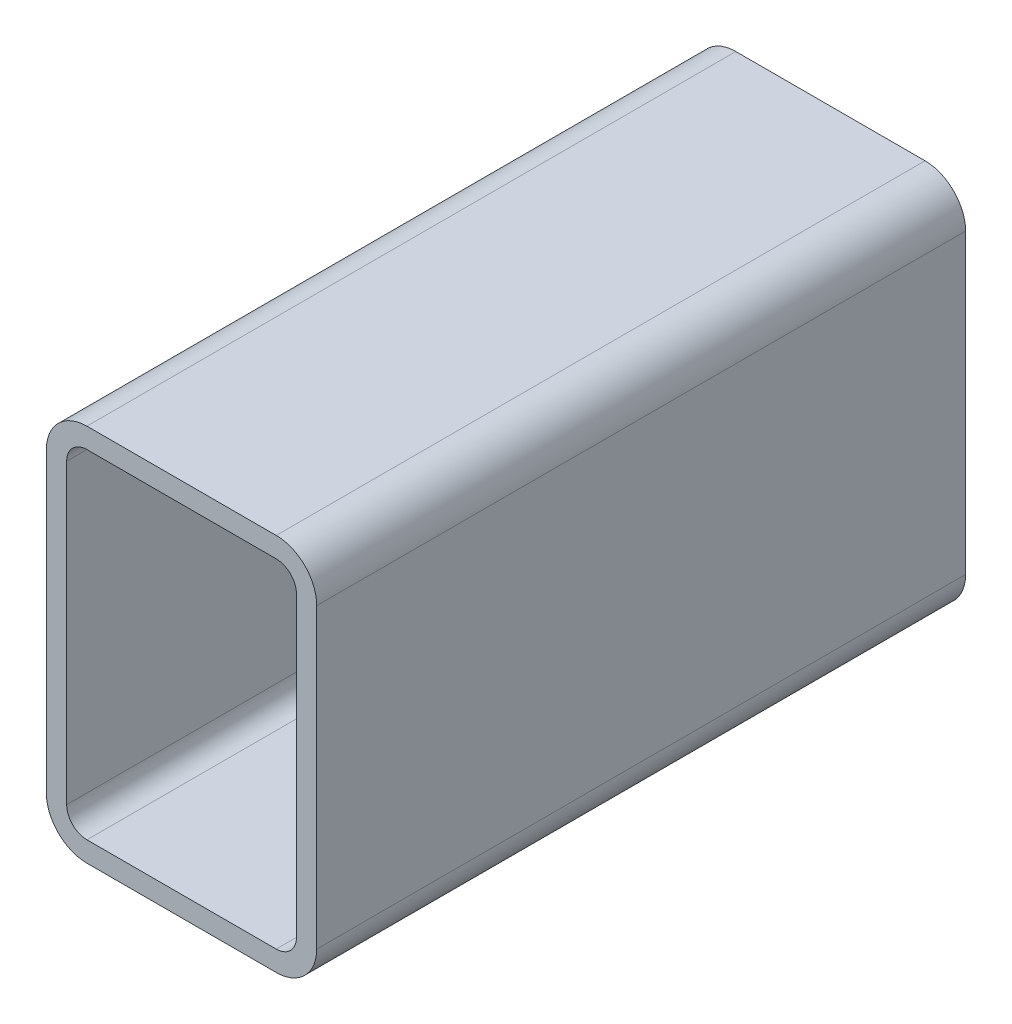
ISO-10303-21;
HEADER;
FILE_DESCRIPTION(('STEP AP214'),'2;1');
FILE_NAME('part.step','',(''),(''),'','','');
FILE_SCHEMA(('AUTOMOTIVE_DESIGN { 1 0 10303 214 1 1 1 1 }'));
ENDSEC;
DATA;
#1=APPLICATION_CONTEXT('core data for automotive mechanical design processes');
#2=APPLICATION_PROTOCOL_DEFINITION('international standard','automotive_design',2000,#1);
#3=PRODUCT_CONTEXT('',#1,'mechanical');
#4=PRODUCT('Part','Part','',(#3));
#5=PRODUCT_RELATED_PRODUCT_CATEGORY('part','',(#4));
#6=PRODUCT_DEFINITION_FORMATION('','',#4);
#7=PRODUCT_DEFINITION_CONTEXT('part definition',#1,'design');
#8=PRODUCT_DEFINITION('design','',#6,#7);
#9=PRODUCT_DEFINITION_SHAPE('','',#8);
#10=(LENGTH_UNIT() NAMED_UNIT(*) SI_UNIT(.MILLI.,.METRE.));
#11=(NAMED_UNIT(*) PLANE_ANGLE_UNIT() SI_UNIT($,.RADIAN.));
#12=(NAMED_UNIT(*) SI_UNIT($,.STERADIAN.) SOLID_ANGLE_UNIT());
#13=UNCERTAINTY_MEASURE_WITH_UNIT(LENGTH_MEASURE(1.E-05),#10,'distance_accuracy_value','');
#14=(GEOMETRIC_REPRESENTATION_CONTEXT(3) GLOBAL_UNCERTAINTY_ASSIGNED_CONTEXT((#13)) GLOBAL_UNIT_ASSIGNED_CONTEXT((#10,
#11,#12)) REPRESENTATION_CONTEXT('',''));
#15=CARTESIAN_POINT('',(0.,0.,0.));
#16=DIRECTION('',(0.,0.,1.));
#17=DIRECTION('',(1.,0.,0.));
#18=AXIS2_PLACEMENT_3D('',#15,#16,#17);
#19=CARTESIAN_POINT('',(19.9112396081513,160.739039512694,304.8));
#20=DIRECTION('',(0.,0.,1.));
#21=DIRECTION('',(1.,0.,0.));
#22=AXIS2_PLACEMENT_3D('',#19,#20,#21);
#23=PLANE('',#22);
#24=CARTESIAN_POINT('',(19.9112396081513,160.739039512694,304.8));
#25=DIRECTION('',(0.,0.,1.));
#26=DIRECTION('',(1.,0.,0.));
#27=AXIS2_PLACEMENT_3D('',#24,#25,#26);
#28=CIRCLE('',#27,19.05);
#29=CARTESIAN_POINT('',(19.9112396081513,179.789039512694,304.8));
#30=VERTEX_POINT('',#29);
#31=CARTESIAN_POINT('',(0.8612396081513,160.739039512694,304.8));
#32=VERTEX_POINT('',#31);
#33=EDGE_CURVE('E211',#30,#32,#28,.T.);
#34=ORIENTED_EDGE('',*,*,#33,.T.);
#35=DIRECTION('',(0.,-1.,0.));
#36=VECTOR('',#35,1.);
#37=CARTESIAN_POINT('',(0.8612396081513,21.0390395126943,304.8));
#38=LINE('',#37,#36);
#39=CARTESIAN_POINT('',(0.8612396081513,21.0390395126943,304.8));
#40=VERTEX_POINT('',#39);
#41=EDGE_CURVE('E214',#32,#40,#38,.T.);
#42=ORIENTED_EDGE('',*,*,#41,.T.);
#43=CARTESIAN_POINT('',(19.9112396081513,21.0390395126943,304.8));
#44=DIRECTION('',(0.,0.,1.));
#45=DIRECTION('',(1.,0.,0.));
#46=AXIS2_PLACEMENT_3D('',#43,#44,#45);
#47=CIRCLE('',#46,19.05);
#48=CARTESIAN_POINT('',(19.9112396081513,1.98903951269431,304.8));
#49=VERTEX_POINT('',#48);
#50=EDGE_CURVE('E217',#40,#49,#47,.T.);
#51=ORIENTED_EDGE('',*,*,#50,.T.);
#52=DIRECTION('',(1.,0.,0.));
#53=VECTOR('',#52,1.);
#54=CARTESIAN_POINT('',(108.811239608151,1.98903951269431,304.8));
#55=LINE('',#54,#53);
#56=CARTESIAN_POINT('',(108.811239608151,1.98903951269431,304.8));
#57=VERTEX_POINT('',#56);
#58=EDGE_CURVE('E219',#49,#57,#55,.T.);
#59=ORIENTED_EDGE('',*,*,#58,.T.);
#60=CARTESIAN_POINT('',(108.811239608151,21.0390395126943,304.8));
#61=DIRECTION('',(0.,0.,1.));
#62=DIRECTION('',(1.,0.,0.));
#63=AXIS2_PLACEMENT_3D('',#60,#61,#62);
#64=CIRCLE('',#63,19.05);
#65=CARTESIAN_POINT('',(127.861239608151,21.0390395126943,304.8));
#66=VERTEX_POINT('',#65);
#67=EDGE_CURVE('E221',#57,#66,#64,.T.);
#68=ORIENTED_EDGE('',*,*,#67,.T.);
#69=DIRECTION('',(0.,1.,0.));
#70=VECTOR('',#69,1.);
#71=CARTESIAN_POINT('',(127.861239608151,160.739039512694,304.8));
#72=LINE('',#71,#70);
#73=CARTESIAN_POINT('',(127.861239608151,160.739039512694,304.8));
#74=VERTEX_POINT('',#73);
#75=EDGE_CURVE('E223',#66,#74,#72,.T.);
#76=ORIENTED_EDGE('',*,*,#75,.T.);
#77=CARTESIAN_POINT('',(108.811239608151,160.739039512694,304.8));
#78=DIRECTION('',(0.,0.,1.));
#79=DIRECTION('',(1.,0.,0.));
#80=AXIS2_PLACEMENT_3D('',#77,#78,#79);
#81=CIRCLE('',#80,19.05);
#82=CARTESIAN_POINT('',(108.811239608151,179.789039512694,304.8));
#83=VERTEX_POINT('',#82);
#84=EDGE_CURVE('E225',#74,#83,#81,.T.);
#85=ORIENTED_EDGE('',*,*,#84,.T.);
#86=DIRECTION('',(-1.,0.,0.));
#87=VECTOR('',#86,1.);
#88=CARTESIAN_POINT('',(19.9112396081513,179.789039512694,304.8));
#89=LINE('',#88,#87);
#90=EDGE_CURVE('E227',#83,#30,#89,.T.);
#91=ORIENTED_EDGE('',*,*,#90,.T.);
#92=EDGE_LOOP('',(#34,#42,#51,#59,#68,#76,#85,#91));
#93=FACE_BOUND('',#92,.T.);
#94=DIRECTION('',(0.,-1.,0.));
#95=VECTOR('',#94,1.);
#96=CARTESIAN_POINT('',(10.3862396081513,21.0390395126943,304.8));
#97=LINE('',#96,#95);
#98=CARTESIAN_POINT('',(10.3862396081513,160.739039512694,304.8));
#99=VERTEX_POINT('',#98);
#100=CARTESIAN_POINT('',(10.3862396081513,21.0390395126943,304.8));
#101=VERTEX_POINT('',#100);
#102=EDGE_CURVE('E154',#99,#101,#97,.T.);
#103=ORIENTED_EDGE('',*,*,#102,.F.);
#104=CARTESIAN_POINT('',(19.9112396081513,160.739039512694,304.8));
#105=DIRECTION('',(0.,0.,1.));
#106=DIRECTION('',(1.,0.,0.));
#107=AXIS2_PLACEMENT_3D('',#104,#105,#106);
#108=CIRCLE('',#107,9.52500000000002);
#109=CARTESIAN_POINT('',(19.9112396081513,170.264039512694,304.8));
#110=VERTEX_POINT('',#109);
#111=EDGE_CURVE('E146',#110,#99,#108,.T.);
#112=ORIENTED_EDGE('',*,*,#111,.F.);
#113=DIRECTION('',(-1.,0.,0.));
#114=VECTOR('',#113,1.);
#115=CARTESIAN_POINT('',(19.9112396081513,170.264039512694,304.8));
#116=LINE('',#115,#114);
#117=CARTESIAN_POINT('',(108.811239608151,170.264039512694,304.8));
#118=VERTEX_POINT('',#117);
#119=EDGE_CURVE('E179',#118,#110,#116,.T.);
#120=ORIENTED_EDGE('',*,*,#119,.F.);
#121=CARTESIAN_POINT('',(108.811239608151,160.739039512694,304.8));
#122=DIRECTION('',(0.,0.,1.));
#123=DIRECTION('',(1.,0.,0.));
#124=AXIS2_PLACEMENT_3D('',#121,#122,#123);
#125=CIRCLE('',#124,9.52500000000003);
#126=CARTESIAN_POINT('',(118.336239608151,160.739039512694,304.8));
#127=VERTEX_POINT('',#126);
#128=EDGE_CURVE('E177',#127,#118,#125,.T.);
#129=ORIENTED_EDGE('',*,*,#128,.F.);
#130=DIRECTION('',(0.,1.,0.));
#131=VECTOR('',#130,1.);
#132=CARTESIAN_POINT('',(118.336239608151,160.739039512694,304.8));
#133=LINE('',#132,#131);
#134=CARTESIAN_POINT('',(118.336239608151,21.0390395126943,304.8));
#135=VERTEX_POINT('',#134);
#136=EDGE_CURVE('E175',#135,#127,#133,.T.);
#137=ORIENTED_EDGE('',*,*,#136,.F.);
#138=CARTESIAN_POINT('',(108.811239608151,21.0390395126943,304.8));
#139=DIRECTION('',(0.,0.,1.));
#140=DIRECTION('',(1.,0.,0.));
#141=AXIS2_PLACEMENT_3D('',#138,#139,#140);
#142=CIRCLE('',#141,9.52500000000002);
#143=CARTESIAN_POINT('',(108.811239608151,11.5140395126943,304.8));
#144=VERTEX_POINT('',#143);
#145=EDGE_CURVE('E173',#144,#135,#142,.T.);
#146=ORIENTED_EDGE('',*,*,#145,.F.);
#147=DIRECTION('',(1.,0.,0.));
#148=VECTOR('',#147,1.);
#149=CARTESIAN_POINT('',(108.811239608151,11.5140395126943,304.8));
#150=LINE('',#149,#148);
#151=CARTESIAN_POINT('',(19.9112396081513,11.5140395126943,304.8));
#152=VERTEX_POINT('',#151);
#153=EDGE_CURVE('E169',#152,#144,#150,.T.);
#154=ORIENTED_EDGE('',*,*,#153,.F.);
#155=CARTESIAN_POINT('',(19.9112396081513,21.0390395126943,304.8));
#156=DIRECTION('',(0.,0.,1.));
#157=DIRECTION('',(1.,0.,0.));
#158=AXIS2_PLACEMENT_3D('',#155,#156,#157);
#159=CIRCLE('',#158,9.525);
#160=EDGE_CURVE('E167',#101,#152,#159,.T.);
#161=ORIENTED_EDGE('',*,*,#160,.F.);
#162=EDGE_LOOP('',(#103,#112,#120,#129,#137,#146,#154,#161));
#163=FACE_BOUND('',#162,.T.);
#164=ADVANCED_FACE('F33',(#93,#163),#23,.T.);
#165=CARTESIAN_POINT('',(19.9112396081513,160.739039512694,0.));
#166=DIRECTION('',(0.,0.,1.));
#167=DIRECTION('',(1.,0.,0.));
#168=AXIS2_PLACEMENT_3D('',#165,#166,#167);
#169=PLANE('',#168);
#170=CARTESIAN_POINT('',(19.9112396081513,160.739039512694,0.));
#171=DIRECTION('',(0.,0.,1.));
#172=DIRECTION('',(1.,0.,0.));
#173=AXIS2_PLACEMENT_3D('',#170,#171,#172);
#174=CIRCLE('',#173,19.05);
#175=CARTESIAN_POINT('',(19.9112396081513,179.789039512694,0.));
#176=VERTEX_POINT('',#175);
#177=CARTESIAN_POINT('',(0.8612396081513,160.739039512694,0.));
#178=VERTEX_POINT('',#177);
#179=EDGE_CURVE('E162',#176,#178,#174,.T.);
#180=ORIENTED_EDGE('',*,*,#179,.F.);
#181=DIRECTION('',(-1.,0.,0.));
#182=VECTOR('',#181,1.);
#183=CARTESIAN_POINT('',(19.9112396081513,179.789039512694,0.));
#184=LINE('',#183,#182);
#185=CARTESIAN_POINT('',(108.811239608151,179.789039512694,0.));
#186=VERTEX_POINT('',#185);
#187=EDGE_CURVE('E215',#186,#176,#184,.T.);
#188=ORIENTED_EDGE('',*,*,#187,.F.);
#189=CARTESIAN_POINT('',(108.811239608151,160.739039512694,0.));
#190=DIRECTION('',(0.,0.,1.));
#191=DIRECTION('',(1.,0.,0.));
#192=AXIS2_PLACEMENT_3D('',#189,#190,#191);
#193=CIRCLE('',#192,19.05);
#194=CARTESIAN_POINT('',(127.861239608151,160.739039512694,0.));
#195=VERTEX_POINT('',#194);
#196=EDGE_CURVE('E242',#195,#186,#193,.T.);
#197=ORIENTED_EDGE('',*,*,#196,.F.);
#198=DIRECTION('',(0.,1.,0.));
#199=VECTOR('',#198,1.);
#200=CARTESIAN_POINT('',(127.861239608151,160.739039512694,0.));
#201=LINE('',#200,#199);
#202=CARTESIAN_POINT('',(127.861239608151,21.0390395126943,0.));
#203=VERTEX_POINT('',#202);
#204=EDGE_CURVE('E240',#203,#195,#201,.T.);
#205=ORIENTED_EDGE('',*,*,#204,.F.);
#206=CARTESIAN_POINT('',(108.811239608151,21.0390395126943,0.));
#207=DIRECTION('',(0.,0.,1.));
#208=DIRECTION('',(1.,0.,0.));
#209=AXIS2_PLACEMENT_3D('',#206,#207,#208);
#210=CIRCLE('',#209,19.05);
#211=CARTESIAN_POINT('',(108.811239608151,1.98903951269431,0.));
#212=VERTEX_POINT('',#211);
#213=EDGE_CURVE('E238',#212,#203,#210,.T.);
#214=ORIENTED_EDGE('',*,*,#213,.F.);
#215=DIRECTION('',(1.,0.,0.));
#216=VECTOR('',#215,1.);
#217=CARTESIAN_POINT('',(108.811239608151,1.98903951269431,0.));
#218=LINE('',#217,#216);
#219=CARTESIAN_POINT('',(19.9112396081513,1.98903951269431,0.));
#220=VERTEX_POINT('',#219);
#221=EDGE_CURVE('E236',#220,#212,#218,.T.);
#222=ORIENTED_EDGE('',*,*,#221,.F.);
#223=CARTESIAN_POINT('',(19.9112396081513,21.0390395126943,0.));
#224=DIRECTION('',(0.,0.,1.));
#225=DIRECTION('',(1.,0.,0.));
#226=AXIS2_PLACEMENT_3D('',#223,#224,#225);
#227=CIRCLE('',#226,19.05);
#228=CARTESIAN_POINT('',(0.8612396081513,21.0390395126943,0.));
#229=VERTEX_POINT('',#228);
#230=EDGE_CURVE('E234',#229,#220,#227,.T.);
#231=ORIENTED_EDGE('',*,*,#230,.F.);
#232=DIRECTION('',(0.,-1.,0.));
#233=VECTOR('',#232,1.);
#234=CARTESIAN_POINT('',(0.8612396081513,21.0390395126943,0.));
#235=LINE('',#234,#233);
#236=EDGE_CURVE('E232',#178,#229,#235,.T.);
#237=ORIENTED_EDGE('',*,*,#236,.F.);
#238=EDGE_LOOP('',(#180,#188,#197,#205,#214,#222,#231,#237));
#239=FACE_BOUND('',#238,.T.);
#240=CARTESIAN_POINT('',(19.9112396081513,160.739039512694,0.));
#241=DIRECTION('',(0.,0.,1.));
#242=DIRECTION('',(1.,0.,0.));
#243=AXIS2_PLACEMENT_3D('',#240,#241,#242);
#244=CIRCLE('',#243,9.52500000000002);
#245=CARTESIAN_POINT('',(19.9112396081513,170.264039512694,0.));
#246=VERTEX_POINT('',#245);
#247=CARTESIAN_POINT('',(10.3862396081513,160.739039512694,0.));
#248=VERTEX_POINT('',#247);
#249=EDGE_CURVE('E56',#246,#248,#244,.T.);
#250=ORIENTED_EDGE('',*,*,#249,.T.);
#251=DIRECTION('',(0.,-1.,0.));
#252=VECTOR('',#251,1.);
#253=CARTESIAN_POINT('',(10.3862396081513,21.0390395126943,0.));
#254=LINE('',#253,#252);
#255=CARTESIAN_POINT('',(10.3862396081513,21.0390395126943,0.));
#256=VERTEX_POINT('',#255);
#257=EDGE_CURVE('E161',#248,#256,#254,.T.);
#258=ORIENTED_EDGE('',*,*,#257,.T.);
#259=CARTESIAN_POINT('',(19.9112396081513,21.0390395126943,0.));
#260=DIRECTION('',(0.,0.,1.));
#261=DIRECTION('',(1.,0.,0.));
#262=AXIS2_PLACEMENT_3D('',#259,#260,#261);
#263=CIRCLE('',#262,9.525);
#264=CARTESIAN_POINT('',(19.9112396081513,11.5140395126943,0.));
#265=VERTEX_POINT('',#264);
#266=EDGE_CURVE('E183',#256,#265,#263,.T.);
#267=ORIENTED_EDGE('',*,*,#266,.T.);
#268=DIRECTION('',(1.,0.,0.));
#269=VECTOR('',#268,1.);
#270=CARTESIAN_POINT('',(108.811239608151,11.5140395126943,0.));
#271=LINE('',#270,#269);
#272=CARTESIAN_POINT('',(108.811239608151,11.5140395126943,0.));
#273=VERTEX_POINT('',#272);
#274=EDGE_CURVE('E186',#265,#273,#271,.T.);
#275=ORIENTED_EDGE('',*,*,#274,.T.);
#276=CARTESIAN_POINT('',(108.811239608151,21.0390395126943,0.));
#277=DIRECTION('',(0.,0.,1.));
#278=DIRECTION('',(1.,0.,0.));
#279=AXIS2_PLACEMENT_3D('',#276,#277,#278);
#280=CIRCLE('',#279,9.52500000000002);
#281=CARTESIAN_POINT('',(118.336239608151,21.0390395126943,0.));
#282=VERTEX_POINT('',#281);
#283=EDGE_CURVE('E189',#273,#282,#280,.T.);
#284=ORIENTED_EDGE('',*,*,#283,.T.);
#285=DIRECTION('',(0.,1.,0.));
#286=VECTOR('',#285,1.);
#287=CARTESIAN_POINT('',(118.336239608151,160.739039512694,0.));
#288=LINE('',#287,#286);
#289=CARTESIAN_POINT('',(118.336239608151,160.739039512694,0.));
#290=VERTEX_POINT('',#289);
#291=EDGE_CURVE('E192',#282,#290,#288,.T.);
#292=ORIENTED_EDGE('',*,*,#291,.T.);
#293=CARTESIAN_POINT('',(108.811239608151,160.739039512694,0.));
#294=DIRECTION('',(0.,0.,1.));
#295=DIRECTION('',(1.,0.,0.));
#296=AXIS2_PLACEMENT_3D('',#293,#294,#295);
#297=CIRCLE('',#296,9.52500000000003);
#298=CARTESIAN_POINT('',(108.811239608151,170.264039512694,0.));
#299=VERTEX_POINT('',#298);
#300=EDGE_CURVE('E195',#290,#299,#297,.T.);
#301=ORIENTED_EDGE('',*,*,#300,.T.);
#302=DIRECTION('',(-1.,0.,0.));
#303=VECTOR('',#302,1.);
#304=CARTESIAN_POINT('',(19.9112396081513,170.264039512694,0.));
#305=LINE('',#304,#303);
#306=EDGE_CURVE('E155',#299,#246,#305,.T.);
#307=ORIENTED_EDGE('',*,*,#306,.T.);
#308=EDGE_LOOP('',(#250,#258,#267,#275,#284,#292,#301,#307));
#309=FACE_BOUND('',#308,.T.);
#310=ADVANCED_FACE('F272',(#239,#309),#169,.F.);
#311=CARTESIAN_POINT('',(19.9112396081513,160.739039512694,304.8));
#312=DIRECTION('',(0.,0.,-1.));
#313=DIRECTION('',(-1.,0.,0.));
#314=AXIS2_PLACEMENT_3D('',#311,#312,#313);
#315=CYLINDRICAL_SURFACE('',#314,19.05);
#316=ORIENTED_EDGE('',*,*,#179,.T.);
#317=DIRECTION('',(0.,0.,-1.));
#318=VECTOR('',#317,1.);
#319=CARTESIAN_POINT('',(0.8612396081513,160.739039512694,304.8));
#320=LINE('',#319,#318);
#321=EDGE_CURVE('E11',#32,#178,#320,.T.);
#322=ORIENTED_EDGE('',*,*,#321,.F.);
#323=ORIENTED_EDGE('',*,*,#33,.F.);
#324=DIRECTION('',(0.,0.,-1.));
#325=VECTOR('',#324,1.);
#326=CARTESIAN_POINT('',(19.9112396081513,179.789039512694,304.8));
#327=LINE('',#326,#325);
#328=EDGE_CURVE('E229',#30,#176,#327,.T.);
#329=ORIENTED_EDGE('',*,*,#328,.T.);
#330=EDGE_LOOP('',(#316,#322,#323,#329));
#331=FACE_BOUND('',#330,.T.);
#332=ADVANCED_FACE('F35',(#331),#315,.T.);
#333=CARTESIAN_POINT('',(0.8612396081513,21.0390395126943,304.8));
#334=DIRECTION('',(1.,0.,0.));
#335=DIRECTION('',(0.,0.,-1.));
#336=AXIS2_PLACEMENT_3D('',#333,#334,#335);
#337=PLANE('',#336);
#338=ORIENTED_EDGE('',*,*,#236,.T.);
#339=DIRECTION('',(0.,0.,-1.));
#340=VECTOR('',#339,1.);
#341=CARTESIAN_POINT('',(0.8612396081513,21.0390395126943,304.8));
#342=LINE('',#341,#340);
#343=EDGE_CURVE('E41',#40,#229,#342,.T.);
#344=ORIENTED_EDGE('',*,*,#343,.F.);
#345=ORIENTED_EDGE('',*,*,#41,.F.);
#346=ORIENTED_EDGE('',*,*,#321,.T.);
#347=EDGE_LOOP('',(#338,#344,#345,#346));
#348=FACE_BOUND('',#347,.T.);
#349=ADVANCED_FACE('F289',(#348),#337,.F.);
#350=CARTESIAN_POINT('',(19.9112396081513,21.0390395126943,304.8));
#351=DIRECTION('',(0.,0.,-1.));
#352=DIRECTION('',(-1.,0.,0.));
#353=AXIS2_PLACEMENT_3D('',#350,#351,#352);
#354=CYLINDRICAL_SURFACE('',#353,19.05);
#355=ORIENTED_EDGE('',*,*,#230,.T.);
#356=DIRECTION('',(0.,0.,-1.));
#357=VECTOR('',#356,1.);
#358=CARTESIAN_POINT('',(19.9112396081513,1.98903951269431,304.8));
#359=LINE('',#358,#357);
#360=EDGE_CURVE('E259',#49,#220,#359,.T.);
#361=ORIENTED_EDGE('',*,*,#360,.F.);
#362=ORIENTED_EDGE('',*,*,#50,.F.);
#363=ORIENTED_EDGE('',*,*,#343,.T.);
#364=EDGE_LOOP('',(#355,#361,#362,#363));
#365=FACE_BOUND('',#364,.T.);
#366=ADVANCED_FACE('F266',(#365),#354,.T.);
#367=CARTESIAN_POINT('',(108.811239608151,1.98903951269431,304.8));
#368=DIRECTION('',(0.,1.,0.));
#369=DIRECTION('',(0.,0.,1.));
#370=AXIS2_PLACEMENT_3D('',#367,#368,#369);
#371=PLANE('',#370);
#372=ORIENTED_EDGE('',*,*,#221,.T.);
#373=DIRECTION('',(0.,0.,-1.));
#374=VECTOR('',#373,1.);
#375=CARTESIAN_POINT('',(108.811239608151,1.98903951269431,304.8));
#376=LINE('',#375,#374);
#377=EDGE_CURVE('E256',#57,#212,#376,.T.);
#378=ORIENTED_EDGE('',*,*,#377,.F.);
#379=ORIENTED_EDGE('',*,*,#58,.F.);
#380=ORIENTED_EDGE('',*,*,#360,.T.);
#381=EDGE_LOOP('',(#372,#378,#379,#380));
#382=FACE_BOUND('',#381,.T.);
#383=ADVANCED_FACE('F278',(#382),#371,.F.);
#384=CARTESIAN_POINT('',(108.811239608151,21.0390395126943,304.8));
#385=DIRECTION('',(0.,0.,-1.));
#386=DIRECTION('',(-1.,0.,0.));
#387=AXIS2_PLACEMENT_3D('',#384,#385,#386);
#388=CYLINDRICAL_SURFACE('',#387,19.05);
#389=ORIENTED_EDGE('',*,*,#213,.T.);
#390=DIRECTION('',(0.,0.,-1.));
#391=VECTOR('',#390,1.);
#392=CARTESIAN_POINT('',(127.861239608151,21.0390395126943,304.8));
#393=LINE('',#392,#391);
#394=EDGE_CURVE('E253',#66,#203,#393,.T.);
#395=ORIENTED_EDGE('',*,*,#394,.F.);
#396=ORIENTED_EDGE('',*,*,#67,.F.);
#397=ORIENTED_EDGE('',*,*,#377,.T.);
#398=EDGE_LOOP('',(#389,#395,#396,#397));
#399=FACE_BOUND('',#398,.T.);
#400=ADVANCED_FACE('F282',(#399),#388,.T.);
#401=CARTESIAN_POINT('',(127.861239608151,160.739039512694,304.8));
#402=DIRECTION('',(-1.,0.,0.));
#403=DIRECTION('',(0.,0.,1.));
#404=AXIS2_PLACEMENT_3D('',#401,#402,#403);
#405=PLANE('',#404);
#406=ORIENTED_EDGE('',*,*,#204,.T.);
#407=DIRECTION('',(0.,0.,-1.));
#408=VECTOR('',#407,1.);
#409=CARTESIAN_POINT('',(127.861239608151,160.739039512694,304.8));
#410=LINE('',#409,#408);
#411=EDGE_CURVE('E250',#74,#195,#410,.T.);
#412=ORIENTED_EDGE('',*,*,#411,.F.);
#413=ORIENTED_EDGE('',*,*,#75,.F.);
#414=ORIENTED_EDGE('',*,*,#394,.T.);
#415=EDGE_LOOP('',(#406,#412,#413,#414));
#416=FACE_BOUND('',#415,.T.);
#417=ADVANCED_FACE('F302',(#416),#405,.F.);
#418=CARTESIAN_POINT('',(108.811239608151,160.739039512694,304.8));
#419=DIRECTION('',(0.,0.,-1.));
#420=DIRECTION('',(-1.,0.,0.));
#421=AXIS2_PLACEMENT_3D('',#418,#419,#420);
#422=CYLINDRICAL_SURFACE('',#421,19.05);
#423=ORIENTED_EDGE('',*,*,#196,.T.);
#424=DIRECTION('',(0.,0.,-1.));
#425=VECTOR('',#424,1.);
#426=CARTESIAN_POINT('',(108.811239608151,179.789039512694,304.8));
#427=LINE('',#426,#425);
#428=EDGE_CURVE('E247',#83,#186,#427,.T.);
#429=ORIENTED_EDGE('',*,*,#428,.F.);
#430=ORIENTED_EDGE('',*,*,#84,.F.);
#431=ORIENTED_EDGE('',*,*,#411,.T.);
#432=EDGE_LOOP('',(#423,#429,#430,#431));
#433=FACE_BOUND('',#432,.T.);
#434=ADVANCED_FACE('F300',(#433),#422,.T.);
#435=CARTESIAN_POINT('',(19.9112396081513,179.789039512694,304.8));
#436=DIRECTION('',(0.,-1.,0.));
#437=DIRECTION('',(0.,0.,-1.));
#438=AXIS2_PLACEMENT_3D('',#435,#436,#437);
#439=PLANE('',#438);
#440=ORIENTED_EDGE('',*,*,#187,.T.);
#441=ORIENTED_EDGE('',*,*,#328,.F.);
#442=ORIENTED_EDGE('',*,*,#90,.F.);
#443=ORIENTED_EDGE('',*,*,#428,.T.);
#444=EDGE_LOOP('',(#440,#441,#442,#443));
#445=FACE_BOUND('',#444,.T.);
#446=ADVANCED_FACE('F295',(#445),#439,.F.);
#447=CARTESIAN_POINT('',(19.9112396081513,160.739039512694,304.8));
#448=DIRECTION('',(0.,0.,-1.));
#449=DIRECTION('',(-1.,0.,0.));
#450=AXIS2_PLACEMENT_3D('',#447,#448,#449);
#451=CYLINDRICAL_SURFACE('',#450,9.52500000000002);
#452=ORIENTED_EDGE('',*,*,#249,.F.);
#453=DIRECTION('',(0.,0.,-1.));
#454=VECTOR('',#453,1.);
#455=CARTESIAN_POINT('',(19.9112396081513,170.264039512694,304.8));
#456=LINE('',#455,#454);
#457=EDGE_CURVE('E150',#110,#246,#456,.T.);
#458=ORIENTED_EDGE('',*,*,#457,.F.);
#459=ORIENTED_EDGE('',*,*,#111,.T.);
#460=DIRECTION('',(0.,0.,-1.));
#461=VECTOR('',#460,1.);
#462=CARTESIAN_POINT('',(10.3862396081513,160.739039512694,304.8));
#463=LINE('',#462,#461);
#464=EDGE_CURVE('E149',#99,#248,#463,.T.);
#465=ORIENTED_EDGE('',*,*,#464,.T.);
#466=EDGE_LOOP('',(#452,#458,#459,#465));
#467=FACE_BOUND('',#466,.T.);
#468=ADVANCED_FACE('F148',(#467),#451,.F.);
#469=CARTESIAN_POINT('',(10.3862396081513,21.0390395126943,304.8));
#470=DIRECTION('',(1.,0.,0.));
#471=DIRECTION('',(0.,0.,-1.));
#472=AXIS2_PLACEMENT_3D('',#469,#470,#471);
#473=PLANE('',#472);
#474=ORIENTED_EDGE('',*,*,#257,.F.);
#475=ORIENTED_EDGE('',*,*,#464,.F.);
#476=ORIENTED_EDGE('',*,*,#102,.T.);
#477=DIRECTION('',(0.,0.,-1.));
#478=VECTOR('',#477,1.);
#479=CARTESIAN_POINT('',(10.3862396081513,21.0390395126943,304.8));
#480=LINE('',#479,#478);
#481=EDGE_CURVE('E163',#101,#256,#480,.T.);
#482=ORIENTED_EDGE('',*,*,#481,.T.);
#483=EDGE_LOOP('',(#474,#475,#476,#482));
#484=FACE_BOUND('',#483,.T.);
#485=ADVANCED_FACE('F158',(#484),#473,.T.);
#486=CARTESIAN_POINT('',(19.9112396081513,21.0390395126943,304.8));
#487=DIRECTION('',(0.,0.,-1.));
#488=DIRECTION('',(-1.,0.,0.));
#489=AXIS2_PLACEMENT_3D('',#486,#487,#488);
#490=CYLINDRICAL_SURFACE('',#489,9.525);
#491=ORIENTED_EDGE('',*,*,#266,.F.);
#492=ORIENTED_EDGE('',*,*,#481,.F.);
#493=ORIENTED_EDGE('',*,*,#160,.T.);
#494=DIRECTION('',(0.,0.,-1.));
#495=VECTOR('',#494,1.);
#496=CARTESIAN_POINT('',(19.9112396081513,11.5140395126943,304.8));
#497=LINE('',#496,#495);
#498=EDGE_CURVE('E208',#152,#265,#497,.T.);
#499=ORIENTED_EDGE('',*,*,#498,.T.);
#500=EDGE_LOOP('',(#491,#492,#493,#499));
#501=FACE_BOUND('',#500,.T.);
#502=ADVANCED_FACE('F327',(#501),#490,.F.);
#503=CARTESIAN_POINT('',(108.811239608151,11.5140395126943,304.8));
#504=DIRECTION('',(0.,1.,0.));
#505=DIRECTION('',(0.,0.,1.));
#506=AXIS2_PLACEMENT_3D('',#503,#504,#505);
#507=PLANE('',#506);
#508=ORIENTED_EDGE('',*,*,#274,.F.);
#509=ORIENTED_EDGE('',*,*,#498,.F.);
#510=ORIENTED_EDGE('',*,*,#153,.T.);
#511=DIRECTION('',(0.,0.,-1.));
#512=VECTOR('',#511,1.);
#513=CARTESIAN_POINT('',(108.811239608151,11.5140395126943,304.8));
#514=LINE('',#513,#512);
#515=EDGE_CURVE('E206',#144,#273,#514,.T.);
#516=ORIENTED_EDGE('',*,*,#515,.T.);
#517=EDGE_LOOP('',(#508,#509,#510,#516));
#518=FACE_BOUND('',#517,.T.);
#519=ADVANCED_FACE('F331',(#518),#507,.T.);
#520=CARTESIAN_POINT('',(108.811239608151,21.0390395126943,304.8));
#521=DIRECTION('',(0.,0.,-1.));
#522=DIRECTION('',(-1.,0.,0.));
#523=AXIS2_PLACEMENT_3D('',#520,#521,#522);
#524=CYLINDRICAL_SURFACE('',#523,9.52500000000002);
#525=ORIENTED_EDGE('',*,*,#283,.F.);
#526=ORIENTED_EDGE('',*,*,#515,.F.);
#527=ORIENTED_EDGE('',*,*,#145,.T.);
#528=DIRECTION('',(0.,0.,-1.));
#529=VECTOR('',#528,1.);
#530=CARTESIAN_POINT('',(118.336239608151,21.0390395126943,304.8));
#531=LINE('',#530,#529);
#532=EDGE_CURVE('E204',#135,#282,#531,.T.);
#533=ORIENTED_EDGE('',*,*,#532,.T.);
#534=EDGE_LOOP('',(#525,#526,#527,#533));
#535=FACE_BOUND('',#534,.T.);
#536=ADVANCED_FACE('F337',(#535),#524,.F.);
#537=CARTESIAN_POINT('',(118.336239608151,160.739039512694,304.8));
#538=DIRECTION('',(-1.,0.,0.));
#539=DIRECTION('',(0.,0.,1.));
#540=AXIS2_PLACEMENT_3D('',#537,#538,#539);
#541=PLANE('',#540);
#542=ORIENTED_EDGE('',*,*,#291,.F.);
#543=ORIENTED_EDGE('',*,*,#532,.F.);
#544=ORIENTED_EDGE('',*,*,#136,.T.);
#545=DIRECTION('',(0.,0.,-1.));
#546=VECTOR('',#545,1.);
#547=CARTESIAN_POINT('',(118.336239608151,160.739039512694,304.8));
#548=LINE('',#547,#546);
#549=EDGE_CURVE('E202',#127,#290,#548,.T.);
#550=ORIENTED_EDGE('',*,*,#549,.T.);
#551=EDGE_LOOP('',(#542,#543,#544,#550));
#552=FACE_BOUND('',#551,.T.);
#553=ADVANCED_FACE('F341',(#552),#541,.T.);
#554=CARTESIAN_POINT('',(108.811239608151,160.739039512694,304.8));
#555=DIRECTION('',(0.,0.,-1.));
#556=DIRECTION('',(-1.,0.,0.));
#557=AXIS2_PLACEMENT_3D('',#554,#555,#556);
#558=CYLINDRICAL_SURFACE('',#557,9.52500000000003);
#559=ORIENTED_EDGE('',*,*,#300,.F.);
#560=ORIENTED_EDGE('',*,*,#549,.F.);
#561=ORIENTED_EDGE('',*,*,#128,.T.);
#562=DIRECTION('',(0.,0.,-1.));
#563=VECTOR('',#562,1.);
#564=CARTESIAN_POINT('',(108.811239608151,170.264039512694,304.8));
#565=LINE('',#564,#563);
#566=EDGE_CURVE('E48',#118,#299,#565,.T.);
#567=ORIENTED_EDGE('',*,*,#566,.T.);
#568=EDGE_LOOP('',(#559,#560,#561,#567));
#569=FACE_BOUND('',#568,.T.);
#570=ADVANCED_FACE('F345',(#569),#558,.F.);
#571=CARTESIAN_POINT('',(19.9112396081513,170.264039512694,304.8));
#572=DIRECTION('',(0.,-1.,0.));
#573=DIRECTION('',(0.,0.,-1.));
#574=AXIS2_PLACEMENT_3D('',#571,#572,#573);
#575=PLANE('',#574);
#576=ORIENTED_EDGE('',*,*,#306,.F.);
#577=ORIENTED_EDGE('',*,*,#566,.F.);
#578=ORIENTED_EDGE('',*,*,#119,.T.);
#579=ORIENTED_EDGE('',*,*,#457,.T.);
#580=EDGE_LOOP('',(#576,#577,#578,#579));
#581=FACE_BOUND('',#580,.T.);
#582=ADVANCED_FACE('F349',(#581),#575,.T.);
#583=CLOSED_SHELL('',(#164,#310,#332,#349,#366,#383,#400,#417,#434,#446,#468,#485,#502,#519,
#536,#553,#570,#582));
#584=MANIFOLD_SOLID_BREP('B2',#583);
#585=ADVANCED_BREP_SHAPE_REPRESENTATION('',(#18,#584),#14);
#586=SHAPE_DEFINITION_REPRESENTATION(#9,#585);
ENDSEC;
END-ISO-10303-21;
